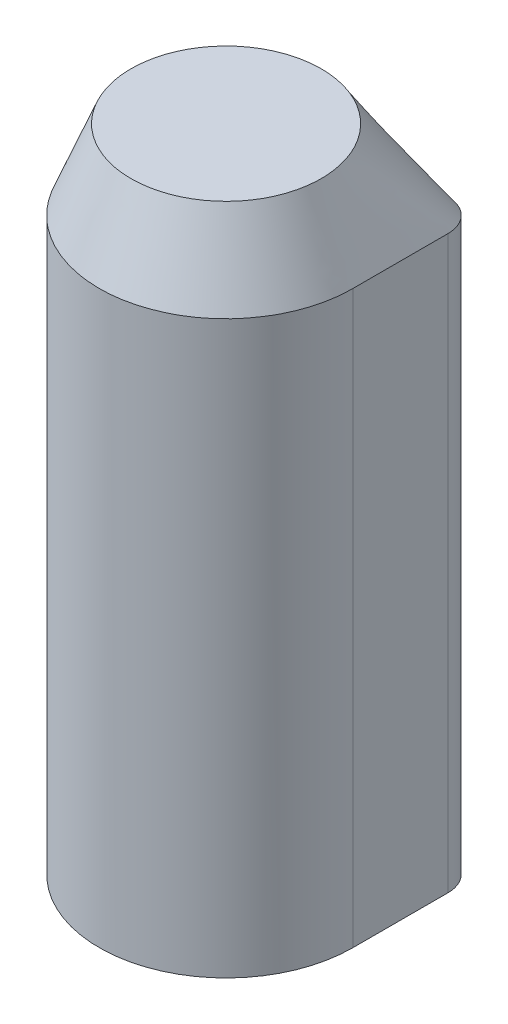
ISO-10303-21;
HEADER;
FILE_DESCRIPTION(('STEP AP214'),'2;1');
FILE_NAME('part.step','',(''),(''),'','','');
FILE_SCHEMA(('AUTOMOTIVE_DESIGN { 1 0 10303 214 1 1 1 1 }'));
ENDSEC;
DATA;
#1=APPLICATION_CONTEXT('core data for automotive mechanical design processes');
#2=APPLICATION_PROTOCOL_DEFINITION('international standard','automotive_design',2000,#1);
#3=PRODUCT_CONTEXT('',#1,'mechanical');
#4=PRODUCT('Part','Part','',(#3));
#5=PRODUCT_RELATED_PRODUCT_CATEGORY('part','',(#4));
#6=PRODUCT_DEFINITION_FORMATION('','',#4);
#7=PRODUCT_DEFINITION_CONTEXT('part definition',#1,'design');
#8=PRODUCT_DEFINITION('design','',#6,#7);
#9=PRODUCT_DEFINITION_SHAPE('','',#8);
#10=(LENGTH_UNIT() NAMED_UNIT(*) SI_UNIT(.MILLI.,.METRE.));
#11=(NAMED_UNIT(*) PLANE_ANGLE_UNIT() SI_UNIT($,.RADIAN.));
#12=(NAMED_UNIT(*) SI_UNIT($,.STERADIAN.) SOLID_ANGLE_UNIT());
#13=UNCERTAINTY_MEASURE_WITH_UNIT(LENGTH_MEASURE(1.E-05),#10,'distance_accuracy_value','');
#14=(GEOMETRIC_REPRESENTATION_CONTEXT(3) GLOBAL_UNCERTAINTY_ASSIGNED_CONTEXT((#13)) GLOBAL_UNIT_ASSIGNED_CONTEXT((#10,
#11,#12)) REPRESENTATION_CONTEXT('',''));
#15=CARTESIAN_POINT('',(0.,0.,0.));
#16=DIRECTION('',(0.,0.,1.));
#17=DIRECTION('',(1.,0.,0.));
#18=AXIS2_PLACEMENT_3D('',#15,#16,#17);
#19=CARTESIAN_POINT('',(2.99998290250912,20.5,-0.0101284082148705));
#20=CARTESIAN_POINT('',(4.,18.,-1.1618070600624E-09));
#21=CARTESIAN_POINT('',(4.01000017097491,17.975,0.000101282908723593));
#22=CARTESIAN_POINT('',(3.00094737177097,20.5,0.275542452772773));
#23=CARTESIAN_POINT('',(4.,18.,0.405177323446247));
#24=CARTESIAN_POINT('',(4.00999052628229,17.975,0.406473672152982));
#25=CARTESIAN_POINT('',(2.91905135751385,20.5,0.850491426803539));
#26=CARTESIAN_POINT('',(3.87525644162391,18.,1.20942767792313));
#27=CARTESIAN_POINT('',(3.88481849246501,17.975,1.21301704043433));
#28=CARTESIAN_POINT('',(2.43724902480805,20.5,1.91792931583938));
#29=CARTESIAN_POINT('',(3.17228880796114,18.,2.66198588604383));
#30=CARTESIAN_POINT('',(3.17963920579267,17.975,2.66942645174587));
#31=CARTESIAN_POINT('',(1.27114461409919,20.5,2.91594707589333));
#32=CARTESIAN_POINT('',(1.56289768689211,18.,3.93753002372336));
#33=CARTESIAN_POINT('',(1.56581521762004,17.975,3.94774585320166));
#34=CARTESIAN_POINT('',(-0.58135705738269,20.5,3.13068499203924));
#35=CARTESIAN_POINT('',(-0.86412465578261,18.,4.14339036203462));
#36=CARTESIAN_POINT('',(-0.866952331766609,17.975,4.15351741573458));
#37=CARTESIAN_POINT('',(-2.24500058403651,20.5,2.26003763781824));
#38=CARTESIAN_POINT('',(-2.99259419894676,17.9999999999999,2.99061824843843));
#39=CARTESIAN_POINT('',(-3.00007013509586,17.9749999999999,2.99792405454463));
#40=CARTESIAN_POINT('',(-3.12682425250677,20.5,0.602102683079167));
#41=CARTESIAN_POINT('',(-4.14386780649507,18.,0.861527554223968));
#42=CARTESIAN_POINT('',(-4.15403824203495,17.9750000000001,0.864121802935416));
#43=CARTESIAN_POINT('',(-2.92423708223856,20.5,-1.25225844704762));
#44=CARTESIAN_POINT('',(-3.93661355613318,18.,-1.56485645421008));
#45=CARTESIAN_POINT('',(-3.94673732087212,17.975,-1.56798243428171));
#46=CARTESIAN_POINT('',(-1.93327609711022,20.5,-2.42522011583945));
#47=CARTESIAN_POINT('',(-2.66082568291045,18.,-3.17310565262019));
#48=CARTESIAN_POINT('',(-2.66810117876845,17.975,-3.18058450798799));
#49=CARTESIAN_POINT('',(-0.8682962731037,20.5,-2.91384641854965));
#50=CARTESIAN_POINT('',(-1.20877265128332,18.,-3.87539871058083));
#51=CARTESIAN_POINT('',(-1.21217741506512,17.975,-3.88501423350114));
#52=CARTESIAN_POINT('',(-0.293529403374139,20.5,-2.99925727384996));
#53=CARTESIAN_POINT('',(-0.404944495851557,18.,-4.));
#54=CARTESIAN_POINT('',(-0.406058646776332,17.975,-4.0100074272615));
#55=CARTESIAN_POINT('',(0.134200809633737,20.5,-3.00035394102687));
#56=CARTESIAN_POINT('',(0.201018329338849,18.,-4.));
#57=CARTESIAN_POINT('',(0.201686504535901,17.975,-4.00999646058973));
#58=CARTESIAN_POINT('',(0.345154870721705,20.5,-2.98399412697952));
#59=CARTESIAN_POINT('',(0.652106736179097,18.,-4.));
#60=CARTESIAN_POINT('',(0.655176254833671,17.975,-4.0101600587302));
#61=CARTESIAN_POINT('',(0.626835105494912,20.5,-2.93907182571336));
#62=CARTESIAN_POINT('',(1.52145032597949,18.,-4.));
#63=CARTESIAN_POINT('',(1.53039647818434,17.975,-4.01060928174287));
#64=CARTESIAN_POINT('',(0.904015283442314,20.5,-2.86447727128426));
#65=CARTESIAN_POINT('',(2.37072215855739,18.,-4.));
#66=CARTESIAN_POINT('',(2.38538922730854,17.975,-4.01135522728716));
#67=CARTESIAN_POINT('',(1.10407164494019,20.5,-2.79329633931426));
#68=CARTESIAN_POINT('',(2.80551738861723,18.,-4.));
#69=CARTESIAN_POINT('',(2.822531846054,17.975,-4.01206703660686));
#70=CARTESIAN_POINT('',(1.30156012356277,20.5,-2.70386293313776));
#71=CARTESIAN_POINT('',(3.09320854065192,18.,-4.));
#72=CARTESIAN_POINT('',(3.11112502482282,17.975,-4.01296137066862));
#73=CARTESIAN_POINT('',(1.4357259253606,20.5,-2.63841246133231));
#74=CARTESIAN_POINT('',(3.24269268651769,18.,-3.9768121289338));
#75=CARTESIAN_POINT('',(3.26076235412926,17.975,-3.99019612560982));
#76=CARTESIAN_POINT('',(1.6552744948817,20.5,-2.50742602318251));
#77=CARTESIAN_POINT('',(3.42589202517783,18.,-3.91124670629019));
#78=CARTESIAN_POINT('',(3.44359820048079,17.975,-3.92528491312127));
#79=CARTESIAN_POINT('',(1.89282902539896,20.5,-2.3333173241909));
#80=CARTESIAN_POINT('',(3.57908702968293,18.,-3.82114414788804));
#81=CARTESIAN_POINT('',(3.59594960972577,17.975,-3.83602241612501));
#82=CARTESIAN_POINT('',(2.12652150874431,20.5,-2.12500192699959));
#83=CARTESIAN_POINT('',(3.71040188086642,18.,-3.71085113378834));
#84=CARTESIAN_POINT('',(3.72624068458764,17.975,-3.72670962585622));
#85=CARTESIAN_POINT('',(2.33448393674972,20.5,-1.89139539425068));
#86=CARTESIAN_POINT('',(3.82078962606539,18.,-3.57958394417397));
#87=CARTESIAN_POINT('',(3.83565268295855,17.975,-3.5964658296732));
#88=CARTESIAN_POINT('',(2.50807931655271,20.5,-1.65422093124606));
#89=CARTESIAN_POINT('',(3.91101860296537,18.,-3.42639953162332));
#90=CARTESIAN_POINT('',(3.9250479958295,17.975,-3.44412131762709));
#91=CARTESIAN_POINT('',(2.63867065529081,20.5,-1.43520174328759));
#92=CARTESIAN_POINT('',(3.97676537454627,18.,-3.24319801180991));
#93=CARTESIAN_POINT('',(3.99014632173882,17.975,-3.26127797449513));
#94=CARTESIAN_POINT('',(2.70393603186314,20.5,-1.30139870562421));
#95=CARTESIAN_POINT('',(4.,18.,-3.09345690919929));
#96=CARTESIAN_POINT('',(4.01296063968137,17.975,-3.11137749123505));
#97=CARTESIAN_POINT('',(2.79282993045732,20.5,-1.10510157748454));
#98=CARTESIAN_POINT('',(4.,18.,-2.8060141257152));
#99=CARTESIAN_POINT('',(4.01207170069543,17.975,-2.82302325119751));
#100=CARTESIAN_POINT('',(2.86289811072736,20.5,-0.908404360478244));
#101=CARTESIAN_POINT('',(4.,18.,-2.37205346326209));
#102=CARTESIAN_POINT('',(4.01137101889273,17.975,-2.38668995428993));
#103=CARTESIAN_POINT('',(2.93701949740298,20.5,-0.63583939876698));
#104=CARTESIAN_POINT('',(4.,18.,-1.52025716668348));
#105=CARTESIAN_POINT('',(4.01062980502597,17.975,-1.52910134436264));
#106=CARTESIAN_POINT('',(2.98221660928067,20.5,-0.358726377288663));
#107=CARTESIAN_POINT('',(4.,18.,-0.64932367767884));
#108=CARTESIAN_POINT('',(4.0101778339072,17.975,-0.652229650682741));
#109=CARTESIAN_POINT('',(2.99950662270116,20.5,-0.151200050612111));
#110=CARTESIAN_POINT('',(4.,18.,-0.200087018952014));
#111=CARTESIAN_POINT('',(4.01000493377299,17.975,-0.200575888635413));
#112=CARTESIAN_POINT('',(2.99998290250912,20.5,-0.0101284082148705));
#113=CARTESIAN_POINT('',(4.,18.,-1.1618070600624E-09));
#114=CARTESIAN_POINT('',(4.01000017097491,17.975,0.000101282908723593));
#115=B_SPLINE_SURFACE_WITH_KNOTS('',3,1,((#19,#20,#21),(#22,#23,#24),(#25,#26,#27),(#28,#29,
#30),(#31,#32,#33),(#34,#35,#36),(#37,#38,#39),(#40,#41,#42),(#43,#44,#45),(#46,#47,#48),(#49,
#50,#51),(#52,#53,#54),(#55,#56,#57),(#58,#59,#60),(#61,#62,#63),(#64,#65,#66),(#67,#68,#69),
(#70,#71,#72),(#73,#74,#75),(#76,#77,#78),(#79,#80,#81),(#82,#83,#84),(#85,#86,#87),(#88,#89,
#90),(#91,#92,#93),(#94,#95,#96),(#97,#98,#99),(#100,#101,#102),(#103,#104,#105),(#106,#107,
#108),(#109,#110,#111),(#112,#113,#114)),.UNSPECIFIED.,.T.,.F.,.F.,(4,1,1,1,1,1,1,1,1,1,2,1,1,1,
2,1,1,1,1,1,1,1,2,1,1,1,4),(2,1,2),(0.,0.045736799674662,0.091473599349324,0.182947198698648,
0.274420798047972,0.365894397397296,0.45736799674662,0.548841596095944,0.640315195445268,
0.68605199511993,0.731788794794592,0.754492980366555,0.777197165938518,0.799901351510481,
0.822605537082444,0.833486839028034,0.844368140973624,0.855249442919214,0.866130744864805,
0.877012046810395,0.887893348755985,0.898774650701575,0.909655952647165,0.932241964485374,
0.954827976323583,0.977413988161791,1.),(0.,1.,1.01),.UNSPECIFIED.);
#116=CARTESIAN_POINT('',(0.,18.,-4.));
#117=CARTESIAN_POINT('',(-0.112495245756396,17.9999832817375,-4.00001207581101));
#118=CARTESIAN_POINT('',(-0.224988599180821,17.9998430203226,-3.99525481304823));
#119=CARTESIAN_POINT('',(-0.449170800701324,17.9995108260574,-3.9762888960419));
#120=CARTESIAN_POINT('',(-0.560859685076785,17.9993188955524,-3.96208067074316));
#121=CARTESIAN_POINT('',(-0.78256723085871,17.9990788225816,-3.92431293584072));
#122=CARTESIAN_POINT('',(-0.892586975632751,17.9990305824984,-3.90075978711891));
#123=CARTESIAN_POINT('',(-1.11025086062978,17.9990910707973,-3.8444736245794));
#124=CARTESIAN_POINT('',(-1.21789503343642,17.999199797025,-3.81174073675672));
#125=CARTESIAN_POINT('',(-1.43009702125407,17.9995696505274,-3.73730808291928));
#126=CARTESIAN_POINT('',(-1.53465328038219,17.9998308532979,-3.69560388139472));
#127=CARTESIAN_POINT('',(-1.73988125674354,18.0004825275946,-3.60353466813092));
#128=CARTESIAN_POINT('',(-1.84055292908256,18.0008730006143,-3.55316955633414));
#129=CARTESIAN_POINT('',(-2.03726817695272,18.0015589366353,-3.44415160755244));
#130=CARTESIAN_POINT('',(-2.13331303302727,18.0018544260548,-3.38550108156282));
#131=CARTESIAN_POINT('',(-2.32012084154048,18.0018586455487,-3.2603191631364));
#132=CARTESIAN_POINT('',(-2.41088383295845,18.0015673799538,-3.19378782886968));
#133=CARTESIAN_POINT('',(-2.58645627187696,18.0007466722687,-3.05333886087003));
#134=CARTESIAN_POINT('',(-2.67126749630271,18.0002173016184,-2.97942344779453));
#135=CARTESIAN_POINT('',(-2.83436606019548,17.9992903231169,-2.82471293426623));
#136=CARTESIAN_POINT('',(-2.9126533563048,17.9988927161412,-2.74391778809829));
#137=CARTESIAN_POINT('',(-3.06218642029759,17.9984221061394,-2.57597785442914));
#138=CARTESIAN_POINT('',(-3.13342848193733,17.998349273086,-2.48882976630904));
#139=CARTESIAN_POINT('',(-3.26831721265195,17.9985674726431,-2.30884175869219));
#140=CARTESIAN_POINT('',(-3.33196387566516,17.9988585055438,-2.21600183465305));
#141=CARTESIAN_POINT('',(-3.45124136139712,17.9996573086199,-2.02523934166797));
#142=CARTESIAN_POINT('',(-3.50686782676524,18.0001651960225,-1.92731404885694));
#143=CARTESIAN_POINT('',(-3.60967359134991,18.0010964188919,-1.72711316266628));
#144=CARTESIAN_POINT('',(-3.65685212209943,18.0015197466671,-1.6248371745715));
#145=CARTESIAN_POINT('',(-3.74234960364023,18.0017240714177,-1.41684227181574));
#146=CARTESIAN_POINT('',(-3.78068290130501,18.0015061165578,-1.31112925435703));
#147=CARTESIAN_POINT('',(-3.8483036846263,18.0008057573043,-1.0968914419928));
#148=CARTESIAN_POINT('',(-3.87759458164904,18.0003234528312,-0.988367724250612));
#149=CARTESIAN_POINT('',(-3.92487421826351,17.9995144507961,-0.778428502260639));
#150=CARTESIAN_POINT('',(-3.94360428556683,17.9991781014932,-0.677179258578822));
#151=CARTESIAN_POINT('',(-3.97320402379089,17.9987586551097,-0.473536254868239));
#152=CARTESIAN_POINT('',(-3.98407358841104,17.998675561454,-0.371142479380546));
#153=CARTESIAN_POINT('',(-3.99851875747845,17.998813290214,-0.156406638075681));
#154=CARTESIAN_POINT('',(-4.00133470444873,17.9990626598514,-0.0440127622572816));
#155=CARTESIAN_POINT('',(-3.99749829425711,17.9997884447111,0.180653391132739));
#156=CARTESIAN_POINT('',(-3.99084227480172,18.0002649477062,0.292925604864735));
#157=CARTESIAN_POINT('',(-3.96808507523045,18.0011721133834,0.5166887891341));
#158=CARTESIAN_POINT('',(-3.95196902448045,18.0016027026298,0.62817824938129));
#159=CARTESIAN_POINT('',(-3.91039634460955,18.001848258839,0.849390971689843));
#160=CARTESIAN_POINT('',(-3.88494065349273,18.0016632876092,0.959114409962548));
#161=CARTESIAN_POINT('',(-3.82488955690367,18.0009741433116,1.17595423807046));
#162=CARTESIAN_POINT('',(-3.79029998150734,18.000470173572,1.28307224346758));
#163=CARTESIAN_POINT('',(-3.71221819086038,17.9995669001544,1.49401635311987));
#164=CARTESIAN_POINT('',(-3.66872576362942,17.9991675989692,1.59784237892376));
#165=CARTESIAN_POINT('',(-3.57316606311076,17.9986724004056,1.80142265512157));
#166=CARTESIAN_POINT('',(-3.52110208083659,17.9985763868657,1.90117844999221));
#167=CARTESIAN_POINT('',(-3.40875705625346,17.9987309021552,2.09595206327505));
#168=CARTESIAN_POINT('',(-3.34847589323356,17.9989814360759,2.19096981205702));
#169=CARTESIAN_POINT('',(-3.22012371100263,17.9996840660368,2.37559336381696));
#170=CARTESIAN_POINT('',(-3.15205242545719,18.0001361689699,2.46519898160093));
#171=CARTESIAN_POINT('',(-3.00860481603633,18.000946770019,2.63835883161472));
#172=CARTESIAN_POINT('',(-2.9332285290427,18.0013052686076,2.72191309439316));
#173=CARTESIAN_POINT('',(-2.77570130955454,18.0014063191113,2.88238169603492));
#174=CARTESIAN_POINT('',(-2.693549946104,18.0011488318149,2.95929561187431));
#175=CARTESIAN_POINT('',(-2.52306140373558,18.0004237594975,3.10593035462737));
#176=CARTESIAN_POINT('',(-2.43472419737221,17.9999561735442,3.17565114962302));
#177=CARTESIAN_POINT('',(-2.25247088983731,17.9991791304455,3.30741928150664));
#178=CARTESIAN_POINT('',(-2.15855358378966,17.9988697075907,3.36946495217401));
#179=CARTESIAN_POINT('',(-1.96586874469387,17.998580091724,3.48539758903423));
#180=CARTESIAN_POINT('',(-1.86710341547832,17.9985997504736,3.53928821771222));
#181=CARTESIAN_POINT('',(-1.66536432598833,17.9989682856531,3.63857160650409));
#182=CARTESIAN_POINT('',(-1.56238966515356,17.9993172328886,3.68396253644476));
#183=CARTESIAN_POINT('',(-1.35298370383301,18.000167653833,3.76590981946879));
#184=CARTESIAN_POINT('',(-1.24655239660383,18.0006691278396,3.80246615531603));
#185=CARTESIAN_POINT('',(-1.03099253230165,18.0014832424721,3.86648351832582));
#186=CARTESIAN_POINT('',(-0.921864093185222,18.0017958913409,3.89394494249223));
#187=CARTESIAN_POINT('',(-0.701682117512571,18.0017640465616,3.9395790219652));
#188=CARTESIAN_POINT('',(-0.59062857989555,18.0014195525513,3.95775167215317));
#189=CARTESIAN_POINT('',(-0.367386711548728,18.0005772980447,3.98467910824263));
#190=CARTESIAN_POINT('',(-0.255198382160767,18.0000795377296,3.993433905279));
#191=CARTESIAN_POINT('',(-0.0304824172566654,17.9992671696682,4.00146362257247));
#192=CARTESIAN_POINT('',(0.0820452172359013,17.9989525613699,4.00073857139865));
#193=CARTESIAN_POINT('',(0.306612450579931,17.9986677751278,3.98981492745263));
#194=CARTESIAN_POINT('',(0.418652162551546,17.9986975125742,3.97961866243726));
#195=CARTESIAN_POINT('',(0.641524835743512,17.9990787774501,3.94982171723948));
#196=CARTESIAN_POINT('',(0.752357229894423,17.9994304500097,3.93021679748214));
#197=CARTESIAN_POINT('',(0.971950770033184,18.0002647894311,3.881745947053));
#198=CARTESIAN_POINT('',(1.08071238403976,18.0007474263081,3.85288213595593));
#199=CARTESIAN_POINT('',(1.29541896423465,18.0014737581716,3.7860968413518));
#200=CARTESIAN_POINT('',(1.40136394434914,18.0017174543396,3.74817540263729));
#201=CARTESIAN_POINT('',(1.60969197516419,18.001555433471,3.66354114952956));
#202=CARTESIAN_POINT('',(1.71207472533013,18.0011496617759,3.61682759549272));
#203=CARTESIAN_POINT('',(1.91254192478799,18.0002316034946,3.51494316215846));
#204=CARTESIAN_POINT('',(2.01062634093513,17.9997193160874,3.45977221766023));
#205=CARTESIAN_POINT('',(2.20180014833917,17.9989019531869,3.34136467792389));
#206=CARTESIAN_POINT('',(2.29488956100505,17.9985968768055,3.27812811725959));
#207=CARTESIAN_POINT('',(2.47541029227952,17.9983474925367,3.1440396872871));
#208=CARTESIAN_POINT('',(2.56284169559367,17.9984031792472,3.0731879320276));
#209=CARTESIAN_POINT('',(2.73142078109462,17.9988454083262,2.924376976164));
#210=CARTESIAN_POINT('',(2.81256882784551,17.9992319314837,2.84641818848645));
#211=CARTESIAN_POINT('',(2.96801088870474,18.0001471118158,2.68394329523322));
#212=CARTESIAN_POINT('',(3.04230485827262,18.0006757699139,2.59942714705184));
#213=CARTESIAN_POINT('',(3.18352240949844,18.0015214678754,2.42442345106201));
#214=CARTESIAN_POINT('',(3.2504448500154,18.0018384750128,2.33393498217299));
#215=CARTESIAN_POINT('',(3.37642825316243,18.0018772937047,2.14764430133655));
#216=CARTESIAN_POINT('',(3.43548937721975,18.001599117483,2.05184219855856));
#217=CARTESIAN_POINT('',(3.54534820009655,18.0009279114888,1.85557468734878));
#218=CARTESIAN_POINT('',(3.59614341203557,18.0005348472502,1.75510788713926));
#219=CARTESIAN_POINT('',(3.68909231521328,17.9998722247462,1.55024238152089));
#220=CARTESIAN_POINT('',(3.73124525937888,17.9996026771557,1.4458433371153));
#221=CARTESIAN_POINT('',(3.80657499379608,17.9992186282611,1.23394505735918));
#222=CARTESIAN_POINT('',(3.83975861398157,17.9991040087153,1.12644825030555));
#223=CARTESIAN_POINT('',(3.89694765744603,17.9990284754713,0.909080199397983));
#224=CARTESIAN_POINT('',(3.92095621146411,17.9990675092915,0.799209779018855));
#225=CARTESIAN_POINT('',(3.9601647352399,17.9992980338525,0.574814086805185));
#226=CARTESIAN_POINT('',(3.97510641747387,17.9994936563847,0.460243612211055));
#227=CARTESIAN_POINT('',(3.99502188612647,17.9998352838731,0.230447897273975));
#228=CARTESIAN_POINT('',(4.00001358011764,17.999981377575,0.11522420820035));
#229=CARTESIAN_POINT('',(4.,18.,0.));
#230=B_SPLINE_CURVE_WITH_KNOTS('',3,(#116,#117,#118,#119,#120,#121,#122,#123,#124,#125,#126,
#127,#128,#129,#130,#131,#132,#133,#134,#135,#136,#137,#138,#139,#140,#141,#142,#143,#144,#145,
#146,#147,#148,#149,#150,#151,#152,#153,#154,#155,#156,#157,#158,#159,#160,#161,#162,#163,#164,
#165,#166,#167,#168,#169,#170,#171,#172,#173,#174,#175,#176,#177,#178,#179,#180,#181,#182,#183,
#184,#185,#186,#187,#188,#189,#190,#191,#192,#193,#194,#195,#196,#197,#198,#199,#200,#201,#202,
#203,#204,#205,#206,#207,#208,#209,#210,#211,#212,#213,#214,#215,#216,#217,#218,#219,#220,#221,
#222,#223,#224,#225,#226,#227,#228,#229),.UNSPECIFIED.,.F.,.F.,(4,2,2,2,2,2,2,2,2,2,2,2,2,2,2,2,
2,2,2,2,2,2,2,2,2,2,2,2,2,2,2,2,2,2,2,2,2,2,2,2,2,2,2,2,2,2,2,2,2,2,2,2,2,2,2,2,4),(0.,
0.337382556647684,0.674749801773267,1.01188780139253,1.34902117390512,1.68632161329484,
2.0236259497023,2.36083638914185,2.69804433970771,3.03515118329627,3.372260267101,
3.70954575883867,4.04683151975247,4.38429984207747,4.72179884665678,5.0587465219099,
5.39556692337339,5.70416701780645,6.01277128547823,6.34965463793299,6.68666828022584,
7.02421311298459,7.36172405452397,7.69902008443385,8.0363241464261,8.37349900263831,
8.71067881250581,9.04787015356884,9.38505979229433,9.72227089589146,10.0594834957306,
10.3967691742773,10.7339029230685,11.0711091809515,11.4083160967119,11.745508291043,
12.0827006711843,12.4198926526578,12.757083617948,13.0941917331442,13.4314518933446,
13.7686349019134,14.1058162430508,14.4430259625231,14.7802382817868,15.1174491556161,
15.4546549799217,15.7918412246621,16.1290296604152,16.4662702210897,16.8035038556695,
17.140838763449,17.4782028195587,17.8153092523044,18.152300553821,18.4984890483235,
18.8440539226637),.UNSPECIFIED.);
#231=CARTESIAN_POINT('',(0.,18.,-4.));
#232=VERTEX_POINT('',#231);
#233=CARTESIAN_POINT('',(4.,18.,0.));
#234=VERTEX_POINT('',#233);
#235=EDGE_CURVE('E11',#232,#234,#230,.T.);
#236=DIRECTION('',(0.,0.,-1.));
#237=VECTOR('',#236,1.);
#238=CARTESIAN_POINT('',(4.,18.,0.));
#239=LINE('',#238,#237);
#240=CARTESIAN_POINT('',(4.,18.,-2.99999999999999));
#241=VERTEX_POINT('',#240);
#242=EDGE_CURVE('E63',#234,#241,#239,.T.);
#243=CARTESIAN_POINT('',(4.,18.,-2.99999999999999));
#244=CARTESIAN_POINT('',(4.00000015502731,18.0000066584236,-3.01406307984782));
#245=CARTESIAN_POINT('',(3.99970334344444,18.0000667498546,-3.02812576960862));
#246=CARTESIAN_POINT('',(3.99851705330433,18.0002147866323,-3.0562261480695));
#247=CARTESIAN_POINT('',(3.99762756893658,18.0003027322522,-3.07026383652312));
#248=CARTESIAN_POINT('',(3.99525727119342,18.0004274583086,-3.09828886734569));
#249=CARTESIAN_POINT('',(3.99377649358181,18.0004642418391,-3.11227621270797));
#250=CARTESIAN_POINT('',(3.99022663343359,18.0004590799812,-3.14017495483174));
#251=CARTESIAN_POINT('',(3.98815755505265,18.000417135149,-3.15408635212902));
#252=CARTESIAN_POINT('',(3.98107624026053,18.0002051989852,-3.19564909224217));
#253=CARTESIAN_POINT('',(3.97518761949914,17.9999491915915,-3.22315618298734));
#254=CARTESIAN_POINT('',(3.96111546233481,17.9997625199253,-3.27757365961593));
#255=CARTESIAN_POINT('',(3.95293195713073,17.9998318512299,-3.30448405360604));
#256=CARTESIAN_POINT('',(3.93432341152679,17.9999606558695,-3.35753344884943));
#257=CARTESIAN_POINT('',(3.92389730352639,18.0000201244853,-3.38367207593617));
#258=CARTESIAN_POINT('',(3.90087985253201,18.0000908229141,-3.43497823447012));
#259=CARTESIAN_POINT('',(3.88828848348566,18.0001020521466,-3.46014575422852));
#260=CARTESIAN_POINT('',(3.86103265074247,18.0000497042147,-3.50932604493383));
#261=CARTESIAN_POINT('',(3.84636856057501,17.9999861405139,-3.53333902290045));
#262=CARTESIAN_POINT('',(3.81506981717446,17.9999308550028,-3.58004434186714));
#263=CARTESIAN_POINT('',(3.79843517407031,17.9999391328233,-3.60273668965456));
#264=CARTESIAN_POINT('',(3.76331432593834,17.9999850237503,-3.64663855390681));
#265=CARTESIAN_POINT('',(3.74482820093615,18.0000226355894,-3.6678481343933));
#266=CARTESIAN_POINT('',(3.70613502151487,18.0000528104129,-3.70863496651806));
#267=CARTESIAN_POINT('',(3.68592795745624,18.0000453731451,-3.72821220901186));
#268=CARTESIAN_POINT('',(3.64393243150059,17.9999920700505,-3.76559880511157));
#269=CARTESIAN_POINT('',(3.62214365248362,17.9999461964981,-3.78340780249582));
#270=CARTESIAN_POINT('',(3.57714351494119,17.999935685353,-3.81712657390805));
#271=CARTESIAN_POINT('',(3.55393217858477,17.9999710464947,-3.83303637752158));
#272=CARTESIAN_POINT('',(3.50624719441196,18.0000434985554,-3.8628467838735));
#273=CARTESIAN_POINT('',(3.48177330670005,18.0000805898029,-3.87674700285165));
#274=CARTESIAN_POINT('',(3.43173951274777,18.0000806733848,-3.90243661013));
#275=CARTESIAN_POINT('',(3.40617953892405,18.0000436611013,-3.91422586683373));
#276=CARTESIAN_POINT('',(3.35417083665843,17.9999108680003,-3.93560312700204));
#277=CARTESIAN_POINT('',(3.32772255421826,17.9998151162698,-3.94519221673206));
#278=CARTESIAN_POINT('',(3.274115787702,17.9997524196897,-3.96210708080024));
#279=CARTESIAN_POINT('',(3.246957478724,17.9997854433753,-3.96943340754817));
#280=CARTESIAN_POINT('',(3.20153318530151,18.0000523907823,-3.9796557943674));
#281=CARTESIAN_POINT('',(3.18341187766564,18.0002135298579,-3.98320952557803));
#282=CARTESIAN_POINT('',(3.14700234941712,18.0004125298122,-3.98930826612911));
#283=CARTESIAN_POINT('',(3.1287141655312,18.0004504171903,-3.99185349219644));
#284=CARTESIAN_POINT('',(3.09205203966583,18.0003934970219,-3.99592473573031));
#285=CARTESIAN_POINT('',(3.073678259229,18.0002988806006,-3.99745221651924));
#286=CARTESIAN_POINT('',(3.03686979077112,18.0001129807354,-3.99949022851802));
#287=CARTESIAN_POINT('',(3.01843508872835,18.0000216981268,-4.00000050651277));
#288=CARTESIAN_POINT('',(2.99999999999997,18.,-4.));
#289=B_SPLINE_CURVE_WITH_KNOTS('',3,(#243,#244,#245,#246,#247,#248,#249,#250,#251,#252,#253,
#254,#255,#256,#257,#258,#259,#260,#261,#262,#263,#264,#265,#266,#267,#268,#269,#270,#271,#272,
#273,#274,#275,#276,#277,#278,#279,#280,#281,#282,#283,#284,#285,#286,#287,#288),.UNSPECIFIED.,
.F.,.F.,(4,2,2,2,2,2,2,2,2,2,2,2,2,2,2,2,2,2,2,2,2,2,4),(0.,0.0421855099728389,
0.0843714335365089,0.126554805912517,0.1687378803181,0.25302240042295,0.337305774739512,
0.421629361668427,0.505953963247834,0.590263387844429,0.674572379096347,0.758877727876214,
0.843183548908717,0.927506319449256,1.01182777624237,1.09616531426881,1.1805081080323,
1.26480917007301,1.34908963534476,1.40446539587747,1.45982924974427,1.51511332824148,
1.57041116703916),.UNSPECIFIED.);
#290=CARTESIAN_POINT('',(3.,18.,-4.));
#291=VERTEX_POINT('',#290);
#292=EDGE_CURVE('E22',#241,#291,#289,.T.);
#293=DIRECTION('',(-1.,0.,0.));
#294=VECTOR('',#293,1.);
#295=CARTESIAN_POINT('',(0.,18.,-4.));
#296=LINE('',#295,#294);
#297=EDGE_CURVE('E60',#291,#232,#296,.T.);
#298=CARTESIAN_POINT('',(-0.00769174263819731,20.5,-2.99999013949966));
#299=CARTESIAN_POINT('',(-0.0497486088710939,20.5,-2.99985323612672));
#300=CARTESIAN_POINT('',(-0.0918069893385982,20.5,-2.9988577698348));
#301=CARTESIAN_POINT('',(-0.175839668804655,20.5,-2.99504707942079));
#302=CARTESIAN_POINT('',(-0.21781396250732,20.5,-2.99223174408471));
#303=CARTESIAN_POINT('',(-0.343533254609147,20.5,-2.98113343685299));
#304=CARTESIAN_POINT('',(-0.427059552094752,20.5,-2.9701982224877));
#305=CARTESIAN_POINT('',(-0.593089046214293,20.5,-2.94137863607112));
#306=CARTESIAN_POINT('',(-0.675589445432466,20.5,-2.92347832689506));
#307=CARTESIAN_POINT('',(-0.838820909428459,20.5,-2.88089963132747));
#308=CARTESIAN_POINT('',(-0.919552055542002,20.5,-2.85622155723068));
#309=CARTESIAN_POINT('',(-1.07863317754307,20.5,-2.80025414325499));
#310=CARTESIAN_POINT('',(-1.15698460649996,20.5,-2.76896893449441));
#311=CARTESIAN_POINT('',(-1.31078293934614,20.5,-2.69993388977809));
#312=CARTESIAN_POINT('',(-1.38623002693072,20.5,-2.66218446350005));
#313=CARTESIAN_POINT('',(-1.53357183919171,20.5,-2.58040216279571));
#314=CARTESIAN_POINT('',(-1.60546912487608,20.5,-2.5363739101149));
#315=CARTESIAN_POINT('',(-1.74517471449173,20.5,-2.44225040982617));
#316=CARTESIAN_POINT('',(-1.81298293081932,20.5,-2.39215503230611));
#317=CARTESIAN_POINT('',(-1.94354039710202,20.5,-2.28689616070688));
#318=CARTESIAN_POINT('',(-2.00632963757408,20.5,-2.23178226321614));
#319=CARTESIAN_POINT('',(-2.12713750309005,20.5,-2.11658151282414));
#320=CARTESIAN_POINT('',(-2.18515597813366,20.5,-2.05649450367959));
#321=CARTESIAN_POINT('',(-2.35160045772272,20.5,-1.86933170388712));
#322=CARTESIAN_POINT('',(-2.45243327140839,20.5,-1.73533975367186));
#323=CARTESIAN_POINT('',(-2.63258880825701,20.5,-1.44926832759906));
#324=CARTESIAN_POINT('',(-2.71135834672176,20.5,-1.29684139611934));
#325=CARTESIAN_POINT('',(-2.84086383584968,20.5,-0.980760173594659));
#326=CARTESIAN_POINT('',(-2.89165793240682,20.5,-0.817129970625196));
#327=CARTESIAN_POINT('',(-2.94257322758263,20.5,-0.586187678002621));
#328=CARTESIAN_POINT('',(-2.95467188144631,20.5,-0.521303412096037));
#329=CARTESIAN_POINT('',(-2.97464187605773,20.5,-0.3908829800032));
#330=CARTESIAN_POINT('',(-2.98251272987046,20.5,-0.32534673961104));
#331=CARTESIAN_POINT('',(-3.00287579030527,20.5,-0.0919018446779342));
#332=CARTESIAN_POINT('',(-3.00362734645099,20.5,0.077263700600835));
#333=CARTESIAN_POINT('',(-2.98347600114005,20.5,0.329183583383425));
#334=CARTESIAN_POINT('',(-2.97318547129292,20.5,0.41295861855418));
#335=CARTESIAN_POINT('',(-2.94537709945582,20.5,0.579321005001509));
#336=CARTESIAN_POINT('',(-2.92786027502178,20.5,0.66190852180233));
#337=CARTESIAN_POINT('',(-2.88583070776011,20.5,0.82519221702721));
#338=CARTESIAN_POINT('',(-2.86132481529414,20.5,0.90589016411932));
#339=CARTESIAN_POINT('',(-2.80565794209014,20.5,1.06493097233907));
#340=CARTESIAN_POINT('',(-2.77449633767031,20.5,1.14327361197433));
#341=CARTESIAN_POINT('',(-2.67141448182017,20.5,1.37402357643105));
#342=CARTESIAN_POINT('',(-2.58985538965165,20.5,1.52231324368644));
#343=CARTESIAN_POINT('',(-2.44960119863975,20.5,1.73367738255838));
#344=CARTESIAN_POINT('',(-2.3995119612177,20.5,1.80266299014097));
#345=CARTESIAN_POINT('',(-2.29362478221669,20.5,1.9361417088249));
#346=CARTESIAN_POINT('',(-2.23782728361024,20.5,2.00063516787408));
#347=CARTESIAN_POINT('',(-2.12080497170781,20.5,2.12448057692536));
#348=CARTESIAN_POINT('',(-2.0595807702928,20.5,2.18383310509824));
#349=CARTESIAN_POINT('',(-1.93222441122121,20.5,2.29698783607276));
#350=CARTESIAN_POINT('',(-1.8660919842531,20.5,2.35078973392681));
#351=CARTESIAN_POINT('',(-1.66413514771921,20.5,2.50130278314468));
#352=CARTESIAN_POINT('',(-1.52212011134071,20.5,2.58986992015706));
#353=CARTESIAN_POINT('',(-1.22556503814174,20.5,2.74269579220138));
#354=CARTESIAN_POINT('',(-1.07102519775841,20.5,2.80695490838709));
#355=CARTESIAN_POINT('',(-0.83097729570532,20.5,2.88413808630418));
#356=CARTESIAN_POINT('',(-0.748506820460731,20.5,2.90682149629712));
#357=CARTESIAN_POINT('',(-0.58188010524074,20.5,2.94489218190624));
#358=CARTESIAN_POINT('',(-0.497723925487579,20.5,2.96027971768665));
#359=CARTESIAN_POINT('',(-0.328373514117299,20.5,2.98364261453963));
#360=CARTESIAN_POINT('',(-0.243179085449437,20.5,2.9916165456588));
#361=CARTESIAN_POINT('',(-0.0724491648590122,20.5,3.0002794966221));
#362=CARTESIAN_POINT('',(0.0130863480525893,20.5,3.00096806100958));
#363=CARTESIAN_POINT('',(0.265306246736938,20.5,2.99233700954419));
#364=CARTESIAN_POINT('',(0.431804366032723,20.5,2.9728768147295));
#365=CARTESIAN_POINT('',(0.677197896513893,20.5,2.92352772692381));
#366=CARTESIAN_POINT('',(0.758288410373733,20.5,2.90371130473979));
#367=CARTESIAN_POINT('',(0.91857022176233,20.5,2.85740225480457));
#368=CARTESIAN_POINT('',(0.997761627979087,20.5,2.83091001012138));
#369=CARTESIAN_POINT('',(1.15510332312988,20.5,2.77069094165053));
#370=CARTESIAN_POINT('',(1.23320376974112,20.5,2.7368339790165));
#371=CARTESIAN_POINT('',(1.38616191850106,20.5,2.66245094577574));
#372=CARTESIAN_POINT('',(1.46101944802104,20.5,2.62192452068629));
#373=CARTESIAN_POINT('',(1.60705582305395,20.5,2.53464228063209));
#374=CARTESIAN_POINT('',(1.67823314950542,20.5,2.48788392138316));
#375=CARTESIAN_POINT('',(1.81639558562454,20.5,2.38858049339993));
#376=CARTESIAN_POINT('',(1.88338040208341,20.5,2.33603502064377));
#377=CARTESIAN_POINT('',(2.07572972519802,20.5,2.17169052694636));
#378=CARTESIAN_POINT('',(2.19453541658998,20.5,2.05195174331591));
#379=CARTESIAN_POINT('',(2.35637600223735,20.5,1.85900510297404));
#380=CARTESIAN_POINT('',(2.40759876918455,20.5,1.79245984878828));
#381=CARTESIAN_POINT('',(2.50419734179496,20.5,1.65515523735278));
#382=CARTESIAN_POINT('',(2.54956831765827,20.5,1.58439246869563));
#383=CARTESIAN_POINT('',(2.67639526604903,20.5,1.36650111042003));
#384=CARTESIAN_POINT('',(2.74851875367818,20.5,1.21382492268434));
#385=CARTESIAN_POINT('',(2.8665395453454,20.5,0.898605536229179));
#386=CARTESIAN_POINT('',(2.9124208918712,20.5,0.73605640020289));
#387=CARTESIAN_POINT('',(2.96320346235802,20.5,0.475204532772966));
#388=CARTESIAN_POINT('',(2.97722338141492,20.5,0.378607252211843));
#389=CARTESIAN_POINT('',(2.99113450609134,20.5,0.233100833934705));
#390=CARTESIAN_POINT('',(2.99458514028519,20.5,0.184521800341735));
#391=CARTESIAN_POINT('',(2.99796901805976,20.5,0.111571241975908));
#392=CARTESIAN_POINT('',(2.9987982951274,20.5,0.0872395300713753));
#393=CARTESIAN_POINT('',(2.99983861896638,20.5,0.0385620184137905));
#394=CARTESIAN_POINT('',(3.00004964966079,20.5,0.0142162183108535));
#395=CARTESIAN_POINT('',(2.99992507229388,20.5,-0.0312207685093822));
#396=CARTESIAN_POINT('',(2.99965872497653,20.5,-0.052312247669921));
#397=CARTESIAN_POINT('',(2.99871272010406,20.5,-0.0944858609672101));
#398=CARTESIAN_POINT('',(2.99803307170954,20.5,-0.115567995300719));
#399=CARTESIAN_POINT('',(2.9961934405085,20.5,-0.157711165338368));
#400=CARTESIAN_POINT('',(2.99503346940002,20.5,-0.17877220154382));
#401=CARTESIAN_POINT('',(2.99220843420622,20.5,-0.220860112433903));
#402=CARTESIAN_POINT('',(2.99054337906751,20.5,-0.241886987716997));
#403=CARTESIAN_POINT('',(2.98671373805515,20.5,-0.283899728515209));
#404=CARTESIAN_POINT('',(2.98454903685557,20.5,-0.304885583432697));
#405=CARTESIAN_POINT('',(2.97982454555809,20.5,-0.346812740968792));
#406=CARTESIAN_POINT('',(2.97726473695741,20.5,-0.367754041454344));
#407=CARTESIAN_POINT('',(2.96903564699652,20.5,-0.430506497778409));
#408=CARTESIAN_POINT('',(2.96281650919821,20.5,-0.472248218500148));
#409=CARTESIAN_POINT('',(2.94857445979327,20.5,-0.555393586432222));
#410=CARTESIAN_POINT('',(2.94055291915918,20.5,-0.596797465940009));
#411=CARTESIAN_POINT('',(2.92257802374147,20.5,-0.679184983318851));
#412=CARTESIAN_POINT('',(2.91262463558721,20.5,-0.720168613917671));
#413=CARTESIAN_POINT('',(2.89099524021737,20.5,-0.801645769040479));
#414=CARTESIAN_POINT('',(2.8793202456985,20.5,-0.842139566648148));
#415=CARTESIAN_POINT('',(2.85465095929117,20.5,-0.922722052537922));
#416=CARTESIAN_POINT('',(2.84165681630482,20.5,-0.962810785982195));
#417=CARTESIAN_POINT('',(2.82072573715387,20.5,-1.02251307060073));
#418=CARTESIAN_POINT('',(2.81349587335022,20.5,-1.04237378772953));
#419=CARTESIAN_POINT('',(2.7985505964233,20.5,-1.08190659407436));
#420=CARTESIAN_POINT('',(2.79083528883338,20.5,-1.10157872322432));
#421=CARTESIAN_POINT('',(2.77496201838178,20.5,-1.14073250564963));
#422=CARTESIAN_POINT('',(2.76680426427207,20.5,-1.16021424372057));
#423=CARTESIAN_POINT('',(2.75010179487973,20.5,-1.19901541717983));
#424=CARTESIAN_POINT('',(2.74155699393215,20.5,-1.21833481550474));
#425=CARTESIAN_POINT('',(2.71789163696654,20.5,-1.2705621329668));
#426=CARTESIAN_POINT('',(2.70243392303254,20.5,-1.30331876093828));
#427=CARTESIAN_POINT('',(2.67034326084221,20.5,-1.36825163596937));
#428=CARTESIAN_POINT('',(2.65371027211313,20.5,-1.40042786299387));
#429=CARTESIAN_POINT('',(2.60197709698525,20.5,-1.49597836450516));
#430=CARTESIAN_POINT('',(2.5650427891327,20.5,-1.55837426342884));
#431=CARTESIAN_POINT('',(2.48647388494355,20.5,-1.68032236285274));
#432=CARTESIAN_POINT('',(2.4448281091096,20.5,-1.73986730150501));
#433=CARTESIAN_POINT('',(2.35760168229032,20.5,-1.85600908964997));
#434=CARTESIAN_POINT('',(2.31202076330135,20.5,-1.91260573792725));
#435=CARTESIAN_POINT('',(2.23667027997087,20.5,-1.99973281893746));
#436=CARTESIAN_POINT('',(2.20816163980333,20.5,-2.0313594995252));
#437=CARTESIAN_POINT('',(2.14975098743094,20.5,-2.09330125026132));
#438=CARTESIAN_POINT('',(2.11984905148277,20.5,-2.123616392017));
#439=CARTESIAN_POINT('',(2.05866905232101,20.5,-2.18283985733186));
#440=CARTESIAN_POINT('',(2.02739059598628,20.5,-2.21174777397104));
#441=CARTESIAN_POINT('',(1.96365301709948,20.5,-2.2682347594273));
#442=CARTESIAN_POINT('',(1.93119377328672,20.5,-2.29581369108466));
#443=CARTESIAN_POINT('',(1.86527852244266,20.5,-2.34957341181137));
#444=CARTESIAN_POINT('',(1.83182532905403,20.5,-2.37575765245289));
#445=CARTESIAN_POINT('',(1.76390464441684,20.5,-2.42677400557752));
#446=CARTESIAN_POINT('',(1.72943719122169,20.5,-2.45160616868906));
#447=CARTESIAN_POINT('',(1.65950323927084,20.5,-2.49977669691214));
#448=CARTESIAN_POINT('',(1.62403738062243,20.5,-2.52311598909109));
#449=CARTESIAN_POINT('',(1.55209836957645,20.5,-2.56817953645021));
#450=CARTESIAN_POINT('',(1.51562531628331,20.5,-2.58990394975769));
#451=CARTESIAN_POINT('',(1.43947368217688,20.5,-2.63296818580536));
#452=CARTESIAN_POINT('',(1.39973559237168,20.5,-2.65420295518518));
#453=CARTESIAN_POINT('',(1.33942810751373,20.5,-2.6846821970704));
#454=CARTESIAN_POINT('',(1.3192035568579,20.5,-2.69461552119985));
#455=CARTESIAN_POINT('',(1.27854121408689,20.5,-2.71404333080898));
#456=CARTESIAN_POINT('',(1.25810338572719,20.5,-2.72353774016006));
#457=CARTESIAN_POINT('',(1.19717894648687,20.5,-2.75114167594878));
#458=CARTESIAN_POINT('',(1.15643557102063,20.5,-2.76869428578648));
#459=CARTESIAN_POINT('',(1.09472334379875,20.5,-2.79354557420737));
#460=CARTESIAN_POINT('',(1.0740511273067,20.5,-2.80158374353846));
#461=CARTESIAN_POINT('',(1.03250665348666,20.5,-2.81712604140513));
#462=CARTESIAN_POINT('',(1.01163439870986,20.5,-2.82463017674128));
#463=CARTESIAN_POINT('',(0.969697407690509,20.5,-2.83911453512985));
#464=CARTESIAN_POINT('',(0.94863257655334,20.5,-2.84609448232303));
#465=CARTESIAN_POINT('',(0.906374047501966,20.5,-2.8596524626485));
#466=CARTESIAN_POINT('',(0.885180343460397,20.5,-2.86623047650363));
#467=CARTESIAN_POINT('',(0.821423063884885,20.5,-2.88537672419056));
#468=CARTESIAN_POINT('',(0.778680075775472,20.5,-2.89735827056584));
#469=CARTESIAN_POINT('',(0.692709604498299,20.5,-2.91936061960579));
#470=CARTESIAN_POINT('',(0.649482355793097,20.5,-2.9293823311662));
#471=CARTESIAN_POINT('',(0.562585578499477,20.5,-2.9472895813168));
#472=CARTESIAN_POINT('',(0.518916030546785,20.5,-2.95517502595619));
#473=CARTESIAN_POINT('',(0.431313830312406,20.5,-2.96901924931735));
#474=CARTESIAN_POINT('',(0.387381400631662,20.5,-2.97497947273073));
#475=CARTESIAN_POINT('',(0.299327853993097,20.5,-2.98528310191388));
#476=CARTESIAN_POINT('',(0.255206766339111,20.5,-2.98962675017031));
#477=CARTESIAN_POINT('',(0.192811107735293,20.5,-2.99413495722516));
#478=CARTESIAN_POINT('',(0.174605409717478,20.5,-2.99525460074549));
#479=CARTESIAN_POINT('',(0.138176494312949,20.5,-2.99712765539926));
#480=CARTESIAN_POINT('',(0.119953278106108,20.5,-2.99788108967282));
#481=CARTESIAN_POINT('',(0.083495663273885,20.5,-2.9990381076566));
#482=CARTESIAN_POINT('',(0.0652612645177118,20.5,-2.99944168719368));
#483=CARTESIAN_POINT('',(0.0287874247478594,20.5,-2.99994740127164));
#484=CARTESIAN_POINT('',(0.0105479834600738,20.5,-3.0000495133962));
#485=CARTESIAN_POINT('',(-0.00769174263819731,20.5,-2.99999013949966));
#486=B_SPLINE_CURVE_WITH_KNOTS('',3,(#298,#299,#300,#301,#302,#303,#304,#305,#306,#307,#308,
#309,#310,#311,#312,#313,#314,#315,#316,#317,#318,#319,#320,#321,#322,#323,#324,#325,#326,#327,
#328,#329,#330,#331,#332,#333,#334,#335,#336,#337,#338,#339,#340,#341,#342,#343,#344,#345,#346,
#347,#348,#349,#350,#351,#352,#353,#354,#355,#356,#357,#358,#359,#360,#361,#362,#363,#364,#365,
#366,#367,#368,#369,#370,#371,#372,#373,#374,#375,#376,#377,#378,#379,#380,#381,#382,#383,#384,
#385,#386,#387,#388,#389,#390,#391,#392,#393,#394,#395,#396,#397,#398,#399,#400,#401,#402,#403,
#404,#405,#406,#407,#408,#409,#410,#411,#412,#413,#414,#415,#416,#417,#418,#419,#420,#421,#422,
#423,#424,#425,#426,#427,#428,#429,#430,#431,#432,#433,#434,#435,#436,#437,#438,#439,#440,#441,
#442,#443,#444,#445,#446,#447,#448,#449,#450,#451,#452,#453,#454,#455,#456,#457,#458,#459,#460,
#461,#462,#463,#464,#465,#466,#467,#468,#469,#470,#471,#472,#473,#474,#475,#476,#477,#478,#479,
#480,#481,#482,#483,#484,#485),.UNSPECIFIED.,.T.,.F.,(4,2,2,2,2,2,2,2,2,2,2,2,2,2,2,2,2,2,2,2,2,
2,2,2,2,2,2,2,2,2,2,2,2,2,2,2,2,2,2,2,2,2,2,2,2,2,2,2,2,2,2,2,2,2,2,2,2,2,2,2,2,2,2,2,2,2,2,2,2,
2,2,2,2,2,2,2,2,2,2,2,2,2,2,2,2,2,2,2,2,2,2,2,2,4),(0.,0.126166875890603,0.25234146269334,
0.504735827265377,0.757711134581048,1.01067478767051,1.26348074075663,1.51627067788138,
1.76887549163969,2.02148571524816,2.2718255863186,2.52217332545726,3.02280106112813,
3.53504103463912,4.04621227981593,4.24411561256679,4.4420417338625,4.94669350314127,
5.199670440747,5.45261176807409,5.70530602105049,5.95802396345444,6.46296863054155,
6.71849408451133,6.97399972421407,7.2294765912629,7.4849674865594,7.98468112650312,
8.4843869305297,8.74071146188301,8.99702685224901,9.25339167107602,9.50977251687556,
10.0099729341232,10.2601890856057,10.5103908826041,10.7654368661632,11.0204964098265,
11.2756604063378,11.5308422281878,12.034123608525,12.2858098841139,12.5377025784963,
13.0417021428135,13.5460078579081,13.8383986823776,13.9844456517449,14.0574762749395,
14.1305087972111,14.1937846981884,14.2570591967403,14.3203321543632,14.383603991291,
14.4468904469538,14.5101798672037,14.6367526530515,14.7632294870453,14.8897085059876,
15.0161134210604,15.1425040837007,15.2059047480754,15.2692916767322,15.3326489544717,
15.3960203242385,15.5046594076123,15.6133022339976,15.8305885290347,16.0484016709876,
16.266229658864,16.3939321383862,16.5216276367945,16.6493598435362,16.7771052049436,
16.9045181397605,17.0319263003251,17.1592545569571,17.2865703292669,17.4216840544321,
17.4892759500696,17.5568795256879,17.6899223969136,17.7564561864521,17.8229891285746,
17.8895568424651,17.9561277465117,18.0892592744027,18.2223289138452,18.3554044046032,
18.488379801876,18.6213352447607,18.6760515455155,18.7307643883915,18.7854778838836,
18.8401954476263),.UNSPECIFIED.);
#487=CARTESIAN_POINT('',(-0.00769174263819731,20.5,-2.99999013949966));
#488=VERTEX_POINT('',#487);
#489=EDGE_CURVE('E88',#488,#488,#486,.T.);
#490=ORIENTED_EDGE('',*,*,#235,.T.);
#491=ORIENTED_EDGE('',*,*,#242,.T.);
#492=ORIENTED_EDGE('',*,*,#292,.T.);
#493=ORIENTED_EDGE('',*,*,#297,.T.);
#494=EDGE_LOOP('',(#490,#491,#492,#493));
#495=FACE_BOUND('',#494,.T.);
#496=ORIENTED_EDGE('',*,*,#489,.F.);
#497=EDGE_LOOP('',(#496));
#498=FACE_BOUND('',#497,.T.);
#499=ADVANCED_FACE('F17',(#495,#498),#115,.T.);
#500=CARTESIAN_POINT('',(3.,18.,-3.));
#501=DIRECTION('',(0.,-1.,0.));
#502=DIRECTION('',(0.,0.,-1.));
#503=AXIS2_PLACEMENT_3D('',#500,#501,#502);
#504=CYLINDRICAL_SURFACE('',#503,1.);
#505=CARTESIAN_POINT('',(3.,0.,-3.));
#506=DIRECTION('',(0.,1.,0.));
#507=DIRECTION('',(0.,0.,1.));
#508=AXIS2_PLACEMENT_3D('',#505,#506,#507);
#509=CIRCLE('',#508,1.);
#510=CARTESIAN_POINT('',(4.,0.,-2.99999999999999));
#511=VERTEX_POINT('',#510);
#512=CARTESIAN_POINT('',(2.99999999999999,0.,-4.));
#513=VERTEX_POINT('',#512);
#514=EDGE_CURVE('E33',#511,#513,#509,.T.);
#515=ORIENTED_EDGE('',*,*,#514,.T.);
#516=DIRECTION('',(0.,-1.,0.));
#517=VECTOR('',#516,1.);
#518=CARTESIAN_POINT('',(2.99999999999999,18.,-4.));
#519=LINE('',#518,#517);
#520=EDGE_CURVE('E68',#291,#513,#519,.T.);
#521=ORIENTED_EDGE('',*,*,#520,.F.);
#522=ORIENTED_EDGE('',*,*,#292,.F.);
#523=DIRECTION('',(0.,-1.,0.));
#524=VECTOR('',#523,1.);
#525=CARTESIAN_POINT('',(4.,18.,-2.99999999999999));
#526=LINE('',#525,#524);
#527=EDGE_CURVE('E212',#241,#511,#526,.T.);
#528=ORIENTED_EDGE('',*,*,#527,.T.);
#529=EDGE_LOOP('',(#515,#521,#522,#528));
#530=FACE_BOUND('',#529,.T.);
#531=ADVANCED_FACE('F69',(#530),#504,.T.);
#532=CARTESIAN_POINT('',(0.,18.,-4.));
#533=DIRECTION('',(0.,0.,1.));
#534=DIRECTION('',(1.,0.,0.));
#535=AXIS2_PLACEMENT_3D('',#532,#533,#534);
#536=PLANE('',#535);
#537=DIRECTION('',(-1.,0.,0.));
#538=VECTOR('',#537,1.);
#539=CARTESIAN_POINT('',(0.,0.,-4.));
#540=LINE('',#539,#538);
#541=CARTESIAN_POINT('',(0.,0.,-4.));
#542=VERTEX_POINT('',#541);
#543=EDGE_CURVE('E74',#513,#542,#540,.T.);
#544=ORIENTED_EDGE('',*,*,#543,.T.);
#545=DIRECTION('',(0.,-1.,0.));
#546=VECTOR('',#545,1.);
#547=CARTESIAN_POINT('',(0.,18.,-4.));
#548=LINE('',#547,#546);
#549=EDGE_CURVE('E79',#232,#542,#548,.T.);
#550=ORIENTED_EDGE('',*,*,#549,.F.);
#551=ORIENTED_EDGE('',*,*,#297,.F.);
#552=ORIENTED_EDGE('',*,*,#520,.T.);
#553=EDGE_LOOP('',(#544,#550,#551,#552));
#554=FACE_BOUND('',#553,.T.);
#555=ADVANCED_FACE('F77',(#554),#536,.F.);
#556=CARTESIAN_POINT('',(0.,18.,0.));
#557=DIRECTION('',(0.,-1.,0.));
#558=DIRECTION('',(0.,0.,-1.));
#559=AXIS2_PLACEMENT_3D('',#556,#557,#558);
#560=CYLINDRICAL_SURFACE('',#559,4.);
#561=CARTESIAN_POINT('',(0.,0.,0.));
#562=DIRECTION('',(0.,1.,0.));
#563=DIRECTION('',(0.,0.,1.));
#564=AXIS2_PLACEMENT_3D('',#561,#562,#563);
#565=CIRCLE('',#564,4.);
#566=CARTESIAN_POINT('',(4.,0.,0.));
#567=VERTEX_POINT('',#566);
#568=EDGE_CURVE('E75',#542,#567,#565,.T.);
#569=ORIENTED_EDGE('',*,*,#568,.T.);
#570=DIRECTION('',(0.,-1.,0.));
#571=VECTOR('',#570,1.);
#572=CARTESIAN_POINT('',(4.,18.,0.));
#573=LINE('',#572,#571);
#574=EDGE_CURVE('E42',#234,#567,#573,.T.);
#575=ORIENTED_EDGE('',*,*,#574,.F.);
#576=ORIENTED_EDGE('',*,*,#235,.F.);
#577=ORIENTED_EDGE('',*,*,#549,.T.);
#578=EDGE_LOOP('',(#569,#575,#576,#577));
#579=FACE_BOUND('',#578,.T.);
#580=ADVANCED_FACE('F94',(#579),#560,.T.);
#581=CARTESIAN_POINT('',(4.,18.,0.));
#582=DIRECTION('',(-1.,0.,0.));
#583=DIRECTION('',(0.,0.,1.));
#584=AXIS2_PLACEMENT_3D('',#581,#582,#583);
#585=PLANE('',#584);
#586=DIRECTION('',(0.,0.,-1.));
#587=VECTOR('',#586,1.);
#588=CARTESIAN_POINT('',(4.,0.,0.));
#589=LINE('',#588,#587);
#590=EDGE_CURVE('E83',#567,#511,#589,.T.);
#591=ORIENTED_EDGE('',*,*,#590,.T.);
#592=ORIENTED_EDGE('',*,*,#527,.F.);
#593=ORIENTED_EDGE('',*,*,#242,.F.);
#594=ORIENTED_EDGE('',*,*,#574,.T.);
#595=EDGE_LOOP('',(#591,#592,#593,#594));
#596=FACE_BOUND('',#595,.T.);
#597=ADVANCED_FACE('F99',(#596),#585,.F.);
#598=CARTESIAN_POINT('',(3.,0.,-3.));
#599=DIRECTION('',(0.,1.,0.));
#600=DIRECTION('',(0.,0.,1.));
#601=AXIS2_PLACEMENT_3D('',#598,#599,#600);
#602=PLANE('',#601);
#603=ORIENTED_EDGE('',*,*,#514,.F.);
#604=ORIENTED_EDGE('',*,*,#590,.F.);
#605=ORIENTED_EDGE('',*,*,#568,.F.);
#606=ORIENTED_EDGE('',*,*,#543,.F.);
#607=EDGE_LOOP('',(#603,#604,#605,#606));
#608=FACE_BOUND('',#607,.T.);
#609=ADVANCED_FACE('F101',(#608),#602,.F.);
#610=CARTESIAN_POINT('',(0.,20.5,0.));
#611=DIRECTION('',(0.,1.,0.));
#612=DIRECTION('',(0.,0.,1.));
#613=AXIS2_PLACEMENT_3D('',#610,#611,#612);
#614=PLANE('',#613);
#615=ORIENTED_EDGE('',*,*,#489,.T.);
#616=EDGE_LOOP('',(#615));
#617=FACE_BOUND('',#616,.T.);
#618=ADVANCED_FACE('F19',(#617),#614,.T.);
#619=CLOSED_SHELL('',(#499,#531,#555,#580,#597,#609,#618));
#620=MANIFOLD_SOLID_BREP('B1',#619);
#621=ADVANCED_BREP_SHAPE_REPRESENTATION('',(#18,#620),#14);
#622=SHAPE_DEFINITION_REPRESENTATION(#9,#621);
ENDSEC;
END-ISO-10303-21;
